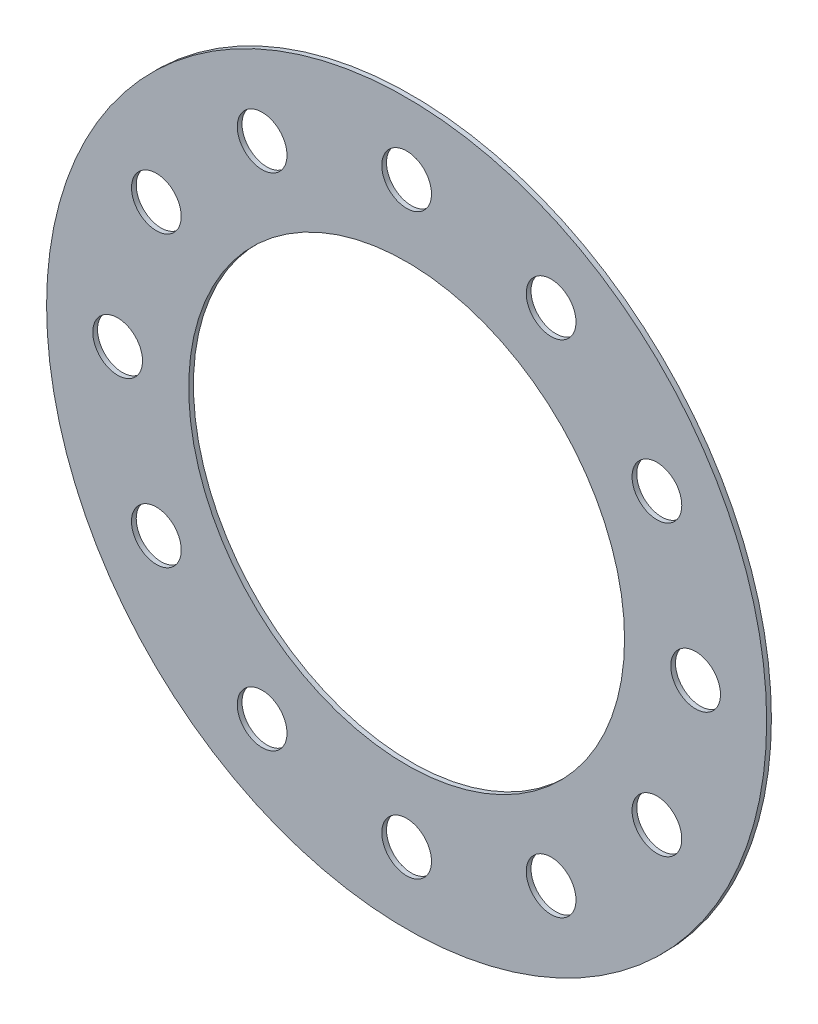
from build123d import *

# Parameters (mm, degrees)
CROQUIS1_R              = 76
CROQUIS1_R_2            = 46
SALIENTE_EXTRUIR1_DEPTH = 1
CROQUIS2_R              = 5.25
CORTAR_EXTRUIR1_DEPTH   = 1
MATRIZC1_COUNT          = 12


with BuildPart() as part:
    # Croquis1 → Saliente-Extruir1 (new body)
    with BuildSketch(Plane.XY):
        Circle(CROQUIS1_R)
        Circle(CROQUIS1_R_2, mode=Mode.SUBTRACT)
    extrude(amount=SALIENTE_EXTRUIR1_DEPTH)

    # Croquis2 → Cortar-Extruir1 (cut)
    with BuildSketch(Plane(origin=(0, 0, 0), x_dir=(-1, 0, 0), z_dir=(0, 0, -1))):
        with Locations((0, 61)):
            Circle(CROQUIS2_R)
    cortar_extruir1 = extrude(amount=-CORTAR_EXTRUIR1_DEPTH, mode=Mode.SUBTRACT)

    # MatrizC1: Cortar-Extruir1 ×12 about axis
    matrizc1_axis = Axis((0, 0, 0), (0, 0, 1))
    for i in range(1, MATRIZC1_COUNT):
        add(cortar_extruir1.rotate(matrizc1_axis, i * 360 / MATRIZC1_COUNT), mode=Mode.SUBTRACT)


solid = part.part
